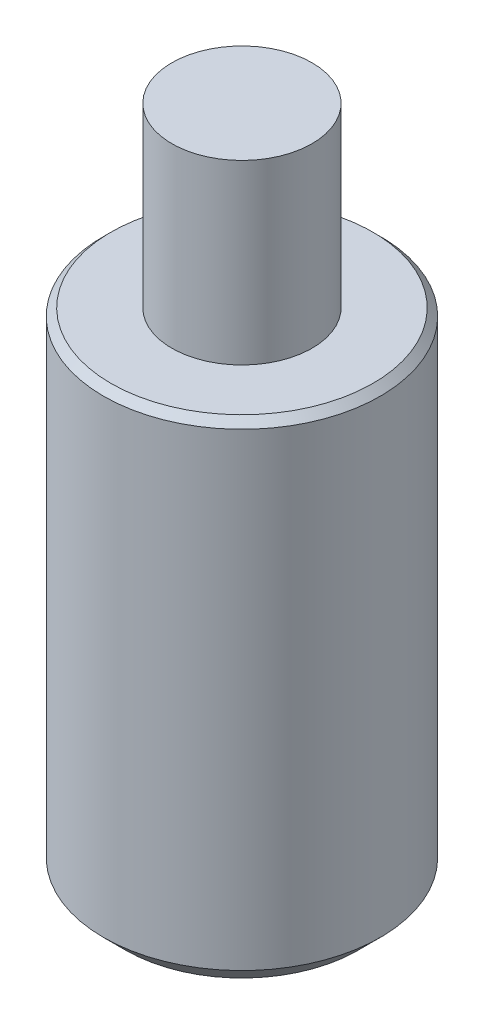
from build123d import *

# Parameters (mm, degrees)
SKETCH1_R      = 4.7625
EXTRUDE1_DEPTH = 17.145
SKETCH2_R      = 2.413
EXTRUDE2_DEPTH = 6.096
CHAMFER1_SIZE  = 0.254
EXTRUDE3_DEPTH = 3.175
CHAMFER2_SIZE  = 0.762


with BuildPart() as part:
    # Sketch1 → Extrude1 (new body)
    with BuildSketch(Plane(origin=(0, 0, 0), x_dir=(1, 0, 0), z_dir=(0, 1, 0))):
        with Locations(Location((0, 0, 0), (0, 0, 270))):
            Circle(SKETCH1_R)
    extrude(amount=EXTRUDE1_DEPTH)

    # Sketch2 → Extrude2 (add)
    with BuildSketch(Plane(origin=(0, 17.145, 0), x_dir=(1, 0, 0), z_dir=(0, 1, 0))):
        with Locations(Location((0, 0, 0), (0, 0, 90))):
            Circle(SKETCH2_R)
    extrude(amount=EXTRUDE2_DEPTH)

    # Chamfer1
    chamfer1_edges = [part.edges().sort_by_distance(p)[0] for p in [
        (0, 17.145, -4.7625),
    ]]
    chamfer(chamfer1_edges, length=CHAMFER1_SIZE)

    # Sketch3 → Extrude3 (cut)
    with BuildSketch(Plane.XZ):
        Polygon((1.378481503, 2.3876), (-1.378481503, 2.3876), (-2.756963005, 0), (-1.378481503, -2.3876), (1.378481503, -2.3876), (2.756963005, 0), align=None)
    extrude(amount=-EXTRUDE3_DEPTH, mode=Mode.SUBTRACT)

    # Chamfer2
    chamfer2_edges = [part.edges().sort_by_distance(p)[0] for p in [
        (0, 0, -4.7625),
    ]]
    chamfer(chamfer2_edges, length=CHAMFER2_SIZE)


solid = part.part
